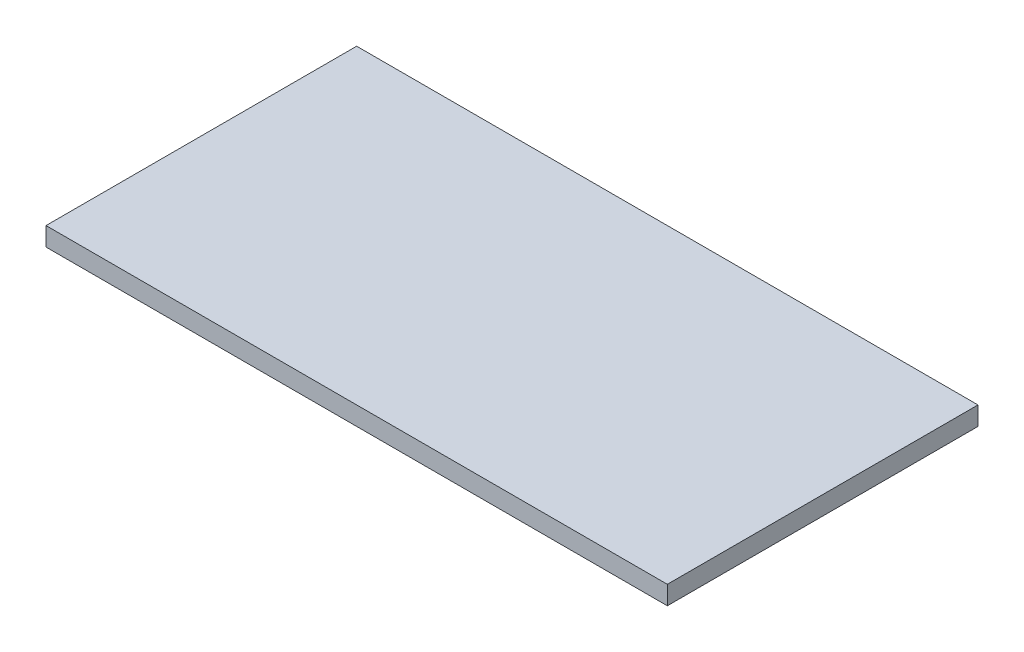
from build123d import *

# Parameters (mm, degrees)
ESQUISSE1_W        = 100
ESQUISSE1_H        = 50
BOSS_EXTRU_1_DEPTH = 3


with BuildPart() as part:
    # Esquisse1 → Boss.-Extru.1 (new body)
    with BuildSketch(Plane(origin=(0, 0, 0), x_dir=(1, 0, 0), z_dir=(0, 1, 0))):
        Rectangle(ESQUISSE1_W, ESQUISSE1_H)
    extrude(amount=BOSS_EXTRU_1_DEPTH)


solid = part.part
